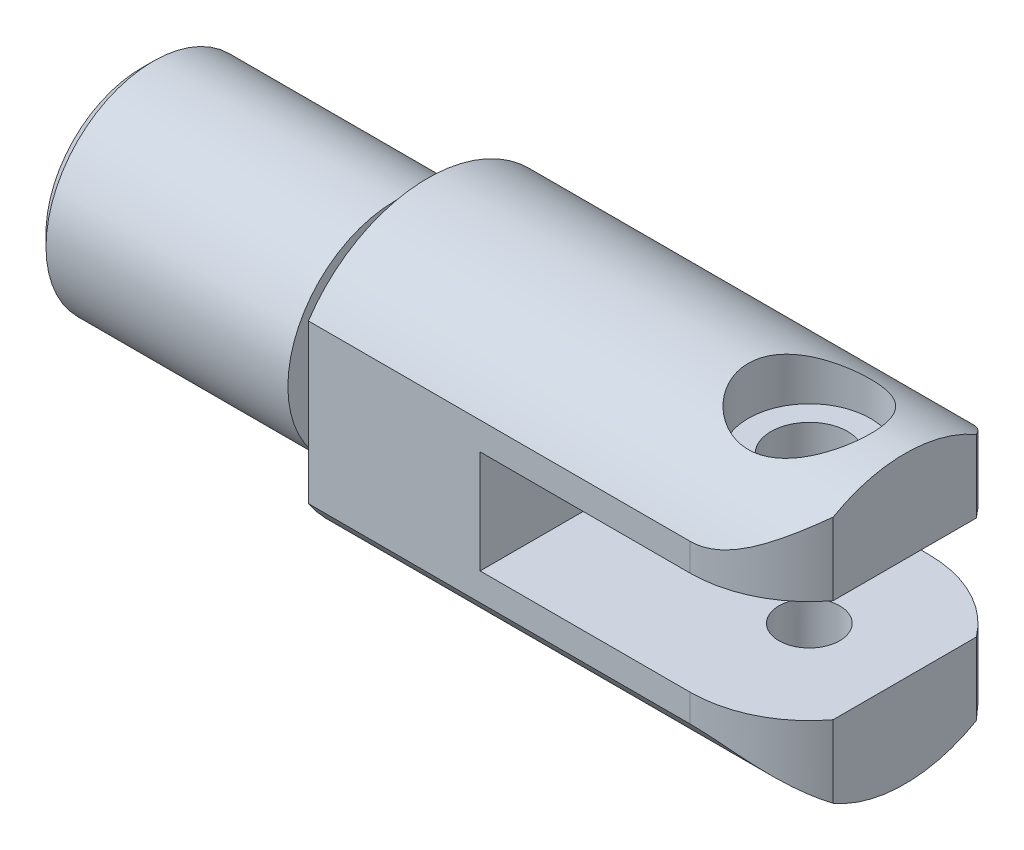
from build123d import *

# Parameters (mm, degrees)
CLEVISSLOT_DEPTH           = 35.48932806
CLEVISSLOT_DEPTH_BACK      = 35.48932806
SKETCH2_W                  = 20.32
SKETCH2_H                  = 6.858
SKETCH3_R                  = 2.0193
F_10_32THREAD_DEPTH        = 35.48932806
SKETCH3_3_R                = 2.5527
SKETCH3_3_R_2              = 2.0193
F_10_32CLEARANCEHOLE_DEPTH = 35.489328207
COUNTERBORE_START          = 6.35
SKETCH3_4_R                = 4.064
SKETCH3_4_R_2              = 2.5527
SKETCH3_4_R_3              = 2.0193
COUNTERBORE_DEPTH          = 29.139328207
CHAMFER1_SIZE              = 0.79375
CUT_EXTRUDE1_DEPTH         = 35.489328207
CUT_EXTRUDE1_DEPTH_BACK    = 35.489328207
SKETCH4_OUTSIDE_W          = 64.3
SKETCH4_OUTSIDE_H          = 32.55


with BuildPart() as part:
    # Sketch1 → Revolve1 (revolve)
    with BuildSketch(Plane.XY, mode=Mode.PRIVATE) as revolve1_sk:
        Polygon((-19.05, 0), (-19.05, 7.14375), (-2.159, 7.14375), (-2.159, 5.715), (0, 5.715), (0, 9.525), (31.75, 9.525), (31.75, 0), align=None)
    revolve(revolve1_sk.sketch.rotate(Axis((-8.177229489, 0, 0), (1, 0, 0)), 90), axis=Axis((-8.177229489, 0, 0), (1, 0, 0)))

    # Sketch2 → ClevisSlot (cut, two sides: drawn at the far end of the back side and taken through both)
    with BuildSketch(Plane.XY.offset(-CLEVISSLOT_DEPTH_BACK)):
        with Locations((21.59, 0)):
            Rectangle(SKETCH2_W, SKETCH2_H)
    extrude(amount=CLEVISSLOT_DEPTH + CLEVISSLOT_DEPTH_BACK, mode=Mode.SUBTRACT)

    # Sketch3 → 10-32Thread (cut, through all)
    with BuildSketch(Plane(origin=(0, 0, 0), x_dir=(1, 0, 0), z_dir=(0, 1, 0))):
        with Locations((25.4, 0)):
            Circle(SKETCH3_R)
    extrude(amount=-F_10_32THREAD_DEPTH, mode=Mode.SUBTRACT)

    # Sketch3_3 → 10-32ClearanceHole (cut, through all)
    # profile 1 of 2: a face of its own
    with BuildSketch(Plane(origin=(0, 0, 0), x_dir=(1, 0, 0), z_dir=(0, 1, 0))):
        with Locations(Location((25.4, 0, 0), (0, 0, 180))):
            Circle(SKETCH3_3_R)
        with Locations((25.4, 0)):
            Circle(SKETCH3_3_R_2, mode=Mode.SUBTRACT)
    # profile 2 of 2: a face of its own
    with BuildSketch(Plane(origin=(0, 0, 0), x_dir=(1, 0, 0), z_dir=(0, 1, 0))):
        with Locations((25.4, 0)):
            Circle(SKETCH3_3_R_2)
    extrude(amount=F_10_32CLEARANCEHOLE_DEPTH, mode=Mode.SUBTRACT)

    # Sketch3_4 → CounterBore (cut, through all)
    # profile 1 of 3: a face of its own
    with BuildSketch(Plane(origin=(0, 0, 0), x_dir=(1, 0, 0), z_dir=(0, 1, 0)).offset(COUNTERBORE_START)):
        with Locations(Location((25.4, 0, 0), (0, 0, 180))):
            Circle(SKETCH3_4_R)
        with Locations(Location((25.4, 0, 0), (0, 0, 90))):
            Circle(SKETCH3_4_R_2, mode=Mode.SUBTRACT)
    # profile 2 of 3: a face of its own
    with BuildSketch(Plane(origin=(0, 0, 0), x_dir=(1, 0, 0), z_dir=(0, 1, 0)).offset(COUNTERBORE_START)):
        with Locations(Location((25.4, 0, 0), (0, 0, 90))):
            Circle(SKETCH3_4_R_2)
        with Locations((25.4, 0)):
            Circle(SKETCH3_4_R_3, mode=Mode.SUBTRACT)
    # profile 3 of 3: a face of its own
    with BuildSketch(Plane(origin=(0, 0, 0), x_dir=(1, 0, 0), z_dir=(0, 1, 0)).offset(COUNTERBORE_START)):
        with Locations((25.4, 0)):
            Circle(SKETCH3_4_R_3)
    extrude(amount=COUNTERBORE_DEPTH, mode=Mode.SUBTRACT)

    # Chamfer1
    chamfer1_edges = [part.edges().sort_by_distance(p)[0] for p in [
        (-19.05, 0, -7.14375),
    ]]
    chamfer(chamfer1_edges, length=CHAMFER1_SIZE)

    # Sketch4 outside → Cut-Extrude1 (cut, two sides: drawn at the far end of the back side and taken through both)
    with BuildSketch(Plane(origin=(0, 0, 0), x_dir=(1, 0, 0), z_dir=(0, 1, 0)).offset(-CUT_EXTRUDE1_DEPTH_BACK)):
        with Locations((6.35, 0)):
            Rectangle(SKETCH4_OUTSIDE_W, SKETCH4_OUTSIDE_H)
        with BuildLine():
            Line((25.4, 7.9375), (-19.05, 7.9375))
            Line((-19.05, 7.9375), (-19.05, -7.9375))
            Line((-19.05, -7.9375), (25.4, -7.9375))
            ThreePointArc((25.4, -7.9375), (33.3375, 0), (25.4, 7.9375))
        make_face(mode=Mode.SUBTRACT)
    extrude(amount=CUT_EXTRUDE1_DEPTH + CUT_EXTRUDE1_DEPTH_BACK, mode=Mode.SUBTRACT)


solid = part.part
